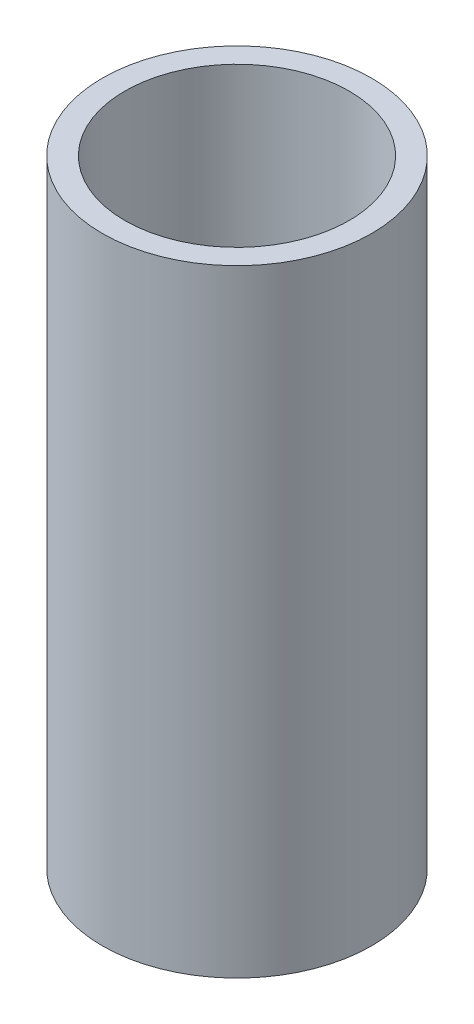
from build123d import *

# Parameters (mm, degrees)
SKETCH1_W = 1
SKETCH1_H = 27.5


with BuildPart() as part:
    # Sketch1 → Revolve1 (revolve)
    with BuildSketch(Plane.XY, mode=Mode.PRIVATE) as revolve1_sk:
        with Locations((5.5, 13.75)):
            Rectangle(SKETCH1_W, SKETCH1_H)
    revolve(revolve1_sk.sketch.rotate(Axis((0, 0, 0), (0, 1, 0)), 90), axis=Axis((0, 0, 0), (0, 1, 0)))


solid = part.part
